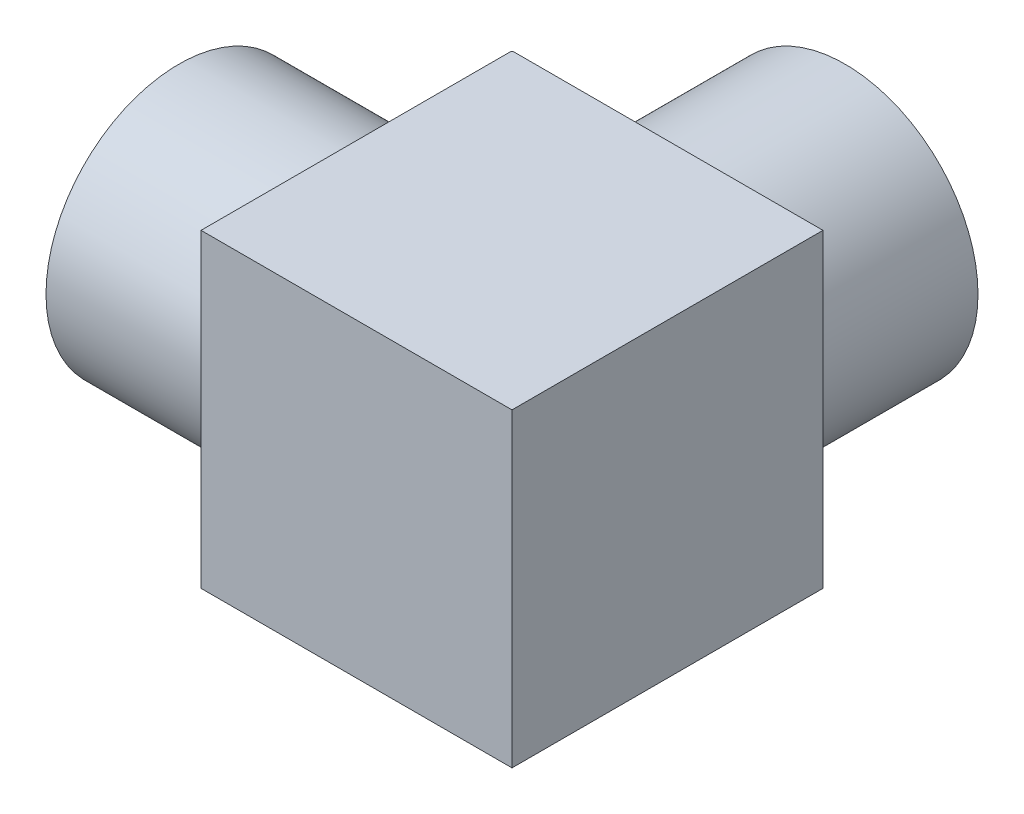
ISO-10303-21;
HEADER;
FILE_DESCRIPTION(('STEP AP214'),'2;1');
FILE_NAME('part.step','',(''),(''),'','','');
FILE_SCHEMA(('AUTOMOTIVE_DESIGN { 1 0 10303 214 1 1 1 1 }'));
ENDSEC;
DATA;
#1=APPLICATION_CONTEXT('core data for automotive mechanical design processes');
#2=APPLICATION_PROTOCOL_DEFINITION('international standard','automotive_design',2000,#1);
#3=PRODUCT_CONTEXT('',#1,'mechanical');
#4=PRODUCT('Part','Part','',(#3));
#5=PRODUCT_RELATED_PRODUCT_CATEGORY('part','',(#4));
#6=PRODUCT_DEFINITION_FORMATION('','',#4);
#7=PRODUCT_DEFINITION_CONTEXT('part definition',#1,'design');
#8=PRODUCT_DEFINITION('design','',#6,#7);
#9=PRODUCT_DEFINITION_SHAPE('','',#8);
#10=(LENGTH_UNIT() NAMED_UNIT(*) SI_UNIT(.MILLI.,.METRE.));
#11=(NAMED_UNIT(*) PLANE_ANGLE_UNIT() SI_UNIT($,.RADIAN.));
#12=(NAMED_UNIT(*) SI_UNIT($,.STERADIAN.) SOLID_ANGLE_UNIT());
#13=UNCERTAINTY_MEASURE_WITH_UNIT(LENGTH_MEASURE(1.E-05),#10,'distance_accuracy_value','');
#14=(GEOMETRIC_REPRESENTATION_CONTEXT(3) GLOBAL_UNCERTAINTY_ASSIGNED_CONTEXT((#13)) GLOBAL_UNIT_ASSIGNED_CONTEXT((#10,
#11,#12)) REPRESENTATION_CONTEXT('',''));
#15=CARTESIAN_POINT('',(0.,0.,0.));
#16=DIRECTION('',(0.,0.,1.));
#17=DIRECTION('',(1.,0.,0.));
#18=AXIS2_PLACEMENT_3D('',#15,#16,#17);
#19=CARTESIAN_POINT('',(6.34999999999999,5.55625000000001,-5.55625));
#20=DIRECTION('',(0.,0.,-1.));
#21=DIRECTION('',(-1.,0.,0.));
#22=AXIS2_PLACEMENT_3D('',#19,#20,#21);
#23=PLANE('',#22);
#24=DIRECTION('',(0.,1.,0.));
#25=VECTOR('',#24,1.);
#26=CARTESIAN_POINT('',(6.34999999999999,0.,-5.55625));
#27=LINE('',#26,#25);
#28=CARTESIAN_POINT('',(6.34999999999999,5.55625000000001,-5.55625));
#29=VERTEX_POINT('',#28);
#30=CARTESIAN_POINT('',(6.34999999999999,-5.55625,-5.55625));
#31=VERTEX_POINT('',#30);
#32=EDGE_CURVE('E166',#29,#31,#27,.F.);
#33=ORIENTED_EDGE('',*,*,#32,.F.);
#34=DIRECTION('',(-1.,0.,0.));
#35=VECTOR('',#34,1.);
#36=CARTESIAN_POINT('',(6.34999999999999,5.55625000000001,-5.55625));
#37=LINE('',#36,#35);
#38=CARTESIAN_POINT('',(6.38175000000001,5.55625000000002,-5.55625));
#39=VERTEX_POINT('',#38);
#40=EDGE_CURVE('E171',#29,#39,#37,.F.);
#41=ORIENTED_EDGE('',*,*,#40,.T.);
#42=DIRECTION('',(0.,-1.,0.));
#43=VECTOR('',#42,1.);
#44=CARTESIAN_POINT('',(6.38175000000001,5.55625000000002,-5.55625));
#45=LINE('',#44,#43);
#46=CARTESIAN_POINT('',(6.38174999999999,-5.55625,-5.55625));
#47=VERTEX_POINT('',#46);
#48=EDGE_CURVE('E163',#47,#39,#45,.F.);
#49=ORIENTED_EDGE('',*,*,#48,.F.);
#50=DIRECTION('',(-1.,0.,0.));
#51=VECTOR('',#50,1.);
#52=CARTESIAN_POINT('',(6.34999999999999,-5.55625,-5.55625));
#53=LINE('',#52,#51);
#54=EDGE_CURVE('E172',#47,#31,#53,.T.);
#55=ORIENTED_EDGE('',*,*,#54,.T.);
#56=EDGE_LOOP('',(#33,#41,#49,#55));
#57=FACE_BOUND('',#56,.T.);
#58=ADVANCED_FACE('F16',(#57),#23,.T.);
#59=CARTESIAN_POINT('',(6.34999999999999,-5.55624999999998,5.55625));
#60=DIRECTION('',(0.,0.,1.));
#61=DIRECTION('',(0.,-1.,0.));
#62=AXIS2_PLACEMENT_3D('',#59,#60,#61);
#63=PLANE('',#62);
#64=DIRECTION('',(0.,1.,0.));
#65=VECTOR('',#64,1.);
#66=CARTESIAN_POINT('',(6.34999999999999,0.,5.55625));
#67=LINE('',#66,#65);
#68=CARTESIAN_POINT('',(6.34999999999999,-5.55624999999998,5.55625));
#69=VERTEX_POINT('',#68);
#70=CARTESIAN_POINT('',(6.34999999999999,5.55625000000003,5.55625));
#71=VERTEX_POINT('',#70);
#72=EDGE_CURVE('E169',#69,#71,#67,.T.);
#73=ORIENTED_EDGE('',*,*,#72,.F.);
#74=DIRECTION('',(1.,0.,0.));
#75=VECTOR('',#74,1.);
#76=CARTESIAN_POINT('',(6.34999999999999,-5.55624999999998,5.55625));
#77=LINE('',#76,#75);
#78=CARTESIAN_POINT('',(17.49425,-5.55624999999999,5.55625));
#79=VERTEX_POINT('',#78);
#80=EDGE_CURVE('E143',#79,#69,#77,.F.);
#81=ORIENTED_EDGE('',*,*,#80,.F.);
#82=DIRECTION('',(0.,1.,0.));
#83=VECTOR('',#82,1.);
#84=CARTESIAN_POINT('',(17.49425,0.,5.55625000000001));
#85=LINE('',#84,#83);
#86=CARTESIAN_POINT('',(17.49425,5.55625000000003,5.55625));
#87=VERTEX_POINT('',#86);
#88=EDGE_CURVE('E150',#87,#79,#85,.F.);
#89=ORIENTED_EDGE('',*,*,#88,.F.);
#90=DIRECTION('',(1.,0.,0.));
#91=VECTOR('',#90,1.);
#92=CARTESIAN_POINT('',(6.34999999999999,5.55625000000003,5.55625));
#93=LINE('',#92,#91);
#94=EDGE_CURVE('E158',#71,#87,#93,.T.);
#95=ORIENTED_EDGE('',*,*,#94,.F.);
#96=EDGE_LOOP('',(#73,#81,#89,#95));
#97=FACE_BOUND('',#96,.T.);
#98=ADVANCED_FACE('F190',(#97),#63,.T.);
#99=CARTESIAN_POINT('',(6.34999999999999,0.,-2.778125));
#100=DIRECTION('',(-1.,0.,0.));
#101=DIRECTION('',(0.,0.,1.));
#102=AXIS2_PLACEMENT_3D('',#99,#100,#101);
#103=PLANE('',#102);
#104=DIRECTION('',(0.,0.,1.));
#105=VECTOR('',#104,1.);
#106=CARTESIAN_POINT('',(6.34999999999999,5.55625000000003,5.55625));
#107=LINE('',#106,#105);
#108=EDGE_CURVE('E160',#29,#71,#107,.T.);
#109=ORIENTED_EDGE('',*,*,#108,.F.);
#110=ORIENTED_EDGE('',*,*,#32,.T.);
#111=DIRECTION('',(0.,0.,1.));
#112=VECTOR('',#111,1.);
#113=CARTESIAN_POINT('',(6.34999999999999,-5.55625,-5.55625));
#114=LINE('',#113,#112);
#115=EDGE_CURVE('E140',#69,#31,#114,.F.);
#116=ORIENTED_EDGE('',*,*,#115,.F.);
#117=ORIENTED_EDGE('',*,*,#72,.T.);
#118=EDGE_LOOP('',(#109,#110,#116,#117));
#119=FACE_BOUND('',#118,.T.);
#120=CARTESIAN_POINT('',(6.34999999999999,0.,0.));
#121=DIRECTION('',(-1.,0.,0.));
#122=DIRECTION('',(0.,0.,1.));
#123=AXIS2_PLACEMENT_3D('',#120,#121,#122);
#124=CIRCLE('',#123,4.7625);
#125=CARTESIAN_POINT('',(6.34999999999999,0.,4.7625));
#126=VERTEX_POINT('',#125);
#127=EDGE_CURVE('E19',#126,#126,#124,.T.);
#128=ORIENTED_EDGE('',*,*,#127,.F.);
#129=EDGE_LOOP('',(#128));
#130=FACE_BOUND('',#129,.T.);
#131=ADVANCED_FACE('F181',(#119,#130),#103,.T.);
#132=CARTESIAN_POINT('',(6.38175000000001,5.55625000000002,0.));
#133=DIRECTION('',(-1.,0.,0.));
#134=DIRECTION('',(0.,-1.,0.));
#135=AXIS2_PLACEMENT_3D('',#132,#133,#134);
#136=PLANE('',#135);
#137=DIRECTION('',(0.,1.,0.));
#138=VECTOR('',#137,1.);
#139=CARTESIAN_POINT('',(6.38175000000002,0.,-5.588));
#140=LINE('',#139,#138);
#141=CARTESIAN_POINT('',(6.38174999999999,-5.55625,-5.588));
#142=VERTEX_POINT('',#141);
#143=CARTESIAN_POINT('',(6.38175000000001,5.55625000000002,-5.588));
#144=VERTEX_POINT('',#143);
#145=EDGE_CURVE('E138',#142,#144,#140,.T.);
#146=ORIENTED_EDGE('',*,*,#145,.F.);
#147=DIRECTION('',(0.,0.,1.));
#148=VECTOR('',#147,1.);
#149=CARTESIAN_POINT('',(6.38174999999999,-5.55625,-5.55625));
#150=LINE('',#149,#148);
#151=EDGE_CURVE('E148',#47,#142,#150,.F.);
#152=ORIENTED_EDGE('',*,*,#151,.F.);
#153=ORIENTED_EDGE('',*,*,#48,.T.);
#154=DIRECTION('',(0.,0.,1.));
#155=VECTOR('',#154,1.);
#156=CARTESIAN_POINT('',(6.38175000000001,5.55625000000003,5.55625));
#157=LINE('',#156,#155);
#158=EDGE_CURVE('E155',#144,#39,#157,.T.);
#159=ORIENTED_EDGE('',*,*,#158,.F.);
#160=EDGE_LOOP('',(#146,#152,#153,#159));
#161=FACE_BOUND('',#160,.T.);
#162=ADVANCED_FACE('F197',(#161),#136,.T.);
#163=CARTESIAN_POINT('',(6.34999999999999,5.55625000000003,5.55625));
#164=DIRECTION('',(0.,1.,0.));
#165=DIRECTION('',(0.,0.,1.));
#166=AXIS2_PLACEMENT_3D('',#163,#164,#165);
#167=PLANE('',#166);
#168=DIRECTION('',(-1.,0.,0.));
#169=VECTOR('',#168,1.);
#170=CARTESIAN_POINT('',(14.716125,5.55625000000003,-5.58799999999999));
#171=LINE('',#170,#169);
#172=CARTESIAN_POINT('',(17.49425,5.55625000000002,-5.58799999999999));
#173=VERTEX_POINT('',#172);
#174=EDGE_CURVE('E133',#144,#173,#171,.F.);
#175=ORIENTED_EDGE('',*,*,#174,.F.);
#176=ORIENTED_EDGE('',*,*,#158,.T.);
#177=ORIENTED_EDGE('',*,*,#40,.F.);
#178=ORIENTED_EDGE('',*,*,#108,.T.);
#179=ORIENTED_EDGE('',*,*,#94,.T.);
#180=DIRECTION('',(0.,0.,1.));
#181=VECTOR('',#180,1.);
#182=CARTESIAN_POINT('',(17.49425,5.55625000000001,0.));
#183=LINE('',#182,#181);
#184=EDGE_CURVE('E152',#173,#87,#183,.T.);
#185=ORIENTED_EDGE('',*,*,#184,.F.);
#186=EDGE_LOOP('',(#175,#176,#177,#178,#179,#185));
#187=FACE_BOUND('',#186,.T.);
#188=ADVANCED_FACE('F193',(#187),#167,.T.);
#189=CARTESIAN_POINT('',(17.49425,0.,0.));
#190=DIRECTION('',(1.,0.,0.));
#191=DIRECTION('',(0.,1.,0.));
#192=AXIS2_PLACEMENT_3D('',#189,#190,#191);
#193=PLANE('',#192);
#194=DIRECTION('',(0.,0.,1.));
#195=VECTOR('',#194,1.);
#196=CARTESIAN_POINT('',(17.49425,-5.55624999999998,-5.55625));
#197=LINE('',#196,#195);
#198=CARTESIAN_POINT('',(17.49425,-5.55624999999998,-5.588));
#199=VERTEX_POINT('',#198);
#200=EDGE_CURVE('E145',#199,#79,#197,.T.);
#201=ORIENTED_EDGE('',*,*,#200,.F.);
#202=DIRECTION('',(0.,1.,0.));
#203=VECTOR('',#202,1.);
#204=CARTESIAN_POINT('',(17.49425,0.,-5.588));
#205=LINE('',#204,#203);
#206=EDGE_CURVE('E128',#173,#199,#205,.F.);
#207=ORIENTED_EDGE('',*,*,#206,.F.);
#208=ORIENTED_EDGE('',*,*,#184,.T.);
#209=ORIENTED_EDGE('',*,*,#88,.T.);
#210=EDGE_LOOP('',(#201,#207,#208,#209));
#211=FACE_BOUND('',#210,.T.);
#212=ADVANCED_FACE('F202',(#211),#193,.T.);
#213=CARTESIAN_POINT('',(6.34999999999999,-5.55625,-5.55625));
#214=DIRECTION('',(0.,-1.,0.));
#215=DIRECTION('',(1.,0.,0.));
#216=AXIS2_PLACEMENT_3D('',#213,#214,#215);
#217=PLANE('',#216);
#218=ORIENTED_EDGE('',*,*,#115,.T.);
#219=ORIENTED_EDGE('',*,*,#54,.F.);
#220=ORIENTED_EDGE('',*,*,#151,.T.);
#221=DIRECTION('',(-1.,0.,0.));
#222=VECTOR('',#221,1.);
#223=CARTESIAN_POINT('',(14.716125,-5.55624999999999,-5.588));
#224=LINE('',#223,#222);
#225=EDGE_CURVE('E124',#199,#142,#224,.T.);
#226=ORIENTED_EDGE('',*,*,#225,.F.);
#227=ORIENTED_EDGE('',*,*,#200,.T.);
#228=ORIENTED_EDGE('',*,*,#80,.T.);
#229=EDGE_LOOP('',(#218,#219,#220,#226,#227,#228));
#230=FACE_BOUND('',#229,.T.);
#231=ADVANCED_FACE('F183',(#230),#217,.T.);
#232=CARTESIAN_POINT('',(3.17500000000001,0.,0.));
#233=DIRECTION('',(-1.,0.,0.));
#234=DIRECTION('',(0.,0.,1.));
#235=AXIS2_PLACEMENT_3D('',#232,#233,#234);
#236=CYLINDRICAL_SURFACE('',#235,4.7625);
#237=CARTESIAN_POINT('',(0.,0.,0.));
#238=DIRECTION('',(-1.,0.,0.));
#239=DIRECTION('',(0.,0.,1.));
#240=AXIS2_PLACEMENT_3D('',#237,#238,#239);
#241=CIRCLE('',#240,4.7625);
#242=CARTESIAN_POINT('',(0.,0.,4.7625));
#243=VERTEX_POINT('',#242);
#244=EDGE_CURVE('E122',#243,#243,#241,.T.);
#245=ORIENTED_EDGE('',*,*,#244,.F.);
#246=EDGE_LOOP('',(#245));
#247=FACE_BOUND('',#246,.T.);
#248=ORIENTED_EDGE('',*,*,#127,.T.);
#249=EDGE_LOOP('',(#248));
#250=FACE_BOUND('',#249,.T.);
#251=ADVANCED_FACE('F209',(#247,#250),#236,.T.);
#252=CARTESIAN_POINT('',(14.716125,0.,-5.588));
#253=DIRECTION('',(0.,0.,-1.));
#254=DIRECTION('',(-1.,0.,0.));
#255=AXIS2_PLACEMENT_3D('',#252,#253,#254);
#256=PLANE('',#255);
#257=ORIENTED_EDGE('',*,*,#206,.T.);
#258=ORIENTED_EDGE('',*,*,#225,.T.);
#259=ORIENTED_EDGE('',*,*,#145,.T.);
#260=ORIENTED_EDGE('',*,*,#174,.T.);
#261=EDGE_LOOP('',(#257,#258,#259,#260));
#262=FACE_BOUND('',#261,.T.);
#263=CARTESIAN_POINT('',(11.938,0.,-5.588));
#264=DIRECTION('',(0.,0.,-1.));
#265=DIRECTION('',(-1.,0.,0.));
#266=AXIS2_PLACEMENT_3D('',#263,#264,#265);
#267=CIRCLE('',#266,4.7625);
#268=CARTESIAN_POINT('',(7.1755,0.,-5.588));
#269=VERTEX_POINT('',#268);
#270=EDGE_CURVE('E118',#269,#269,#267,.T.);
#271=ORIENTED_EDGE('',*,*,#270,.F.);
#272=EDGE_LOOP('',(#271));
#273=FACE_BOUND('',#272,.T.);
#274=ADVANCED_FACE('F198',(#262,#273),#256,.T.);
#275=CARTESIAN_POINT('',(0.,0.,-2.38125));
#276=DIRECTION('',(-1.,0.,0.));
#277=DIRECTION('',(0.,0.,1.));
#278=AXIS2_PLACEMENT_3D('',#275,#276,#277);
#279=PLANE('',#278);
#280=ORIENTED_EDGE('',*,*,#244,.T.);
#281=EDGE_LOOP('',(#280));
#282=FACE_BOUND('',#281,.T.);
#283=CARTESIAN_POINT('',(0.,0.,0.));
#284=DIRECTION('',(1.,0.,0.));
#285=DIRECTION('',(0.,0.,-1.));
#286=AXIS2_PLACEMENT_3D('',#283,#284,#285);
#287=CIRCLE('',#286,3.8735);
#288=CARTESIAN_POINT('',(0.,0.,-3.8735));
#289=VERTEX_POINT('',#288);
#290=EDGE_CURVE('E114',#289,#289,#287,.T.);
#291=ORIENTED_EDGE('',*,*,#290,.T.);
#292=EDGE_LOOP('',(#291));
#293=FACE_BOUND('',#292,.T.);
#294=ADVANCED_FACE('F87',(#282,#293),#279,.T.);
#295=CARTESIAN_POINT('',(11.938,0.,-8.763));
#296=DIRECTION('',(0.,0.,-1.));
#297=DIRECTION('',(-1.,0.,0.));
#298=AXIS2_PLACEMENT_3D('',#295,#296,#297);
#299=CYLINDRICAL_SURFACE('',#298,4.7625);
#300=CARTESIAN_POINT('',(11.938,0.,-11.938));
#301=DIRECTION('',(0.,0.,-1.));
#302=DIRECTION('',(-1.,0.,0.));
#303=AXIS2_PLACEMENT_3D('',#300,#301,#302);
#304=CIRCLE('',#303,4.7625);
#305=CARTESIAN_POINT('',(7.1755,0.,-11.938));
#306=VERTEX_POINT('',#305);
#307=EDGE_CURVE('E105',#306,#306,#304,.T.);
#308=ORIENTED_EDGE('',*,*,#307,.F.);
#309=EDGE_LOOP('',(#308));
#310=FACE_BOUND('',#309,.T.);
#311=ORIENTED_EDGE('',*,*,#270,.T.);
#312=EDGE_LOOP('',(#311));
#313=FACE_BOUND('',#312,.T.);
#314=ADVANCED_FACE('F76',(#310,#313),#299,.T.);
#315=CARTESIAN_POINT('',(11.938,0.,0.));
#316=DIRECTION('',(0.86411097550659,0.4351361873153,0.252920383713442));
#317=DIRECTION('',(-0.477419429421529,0.867734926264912,0.138227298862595));
#318=AXIS2_PLACEMENT_3D('',#315,#316,#317);
#319=SPHERICAL_SURFACE('',#318,3.8735);
#320=CARTESIAN_POINT('',(11.938,0.,0.));
#321=DIRECTION('',(0.,0.,1.));
#322=DIRECTION('',(1.,0.,0.));
#323=AXIS2_PLACEMENT_3D('',#320,#321,#322);
#324=CIRCLE('',#323,3.8735);
#325=CARTESIAN_POINT('',(11.938,3.87350000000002,0.));
#326=VERTEX_POINT('',#325);
#327=CARTESIAN_POINT('',(11.938,-3.8735,0.));
#328=VERTEX_POINT('',#327);
#329=EDGE_CURVE('E104',#326,#328,#324,.F.);
#330=ORIENTED_EDGE('',*,*,#329,.T.);
#331=CARTESIAN_POINT('',(11.938,0.,0.));
#332=DIRECTION('',(1.,0.,0.));
#333=DIRECTION('',(0.,0.,-1.));
#334=AXIS2_PLACEMENT_3D('',#331,#332,#333);
#335=CIRCLE('',#334,3.8735);
#336=EDGE_CURVE('E31',#328,#326,#335,.F.);
#337=ORIENTED_EDGE('',*,*,#336,.T.);
#338=EDGE_LOOP('',(#330,#337));
#339=FACE_BOUND('',#338,.T.);
#340=CARTESIAN_POINT('',(15.2851338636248,1.68550002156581,0.979687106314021));
#341=VERTEX_POINT('',#340);
#342=VERTEX_LOOP('',#341);
#343=FACE_BOUND('',#342,.T.);
#344=ADVANCED_FACE('F73',(#339,#343),#319,.F.);
#345=CARTESIAN_POINT('',(5.969,0.,0.));
#346=DIRECTION('',(1.,0.,0.));
#347=DIRECTION('',(0.,0.,-1.));
#348=AXIS2_PLACEMENT_3D('',#345,#346,#347);
#349=CYLINDRICAL_SURFACE('',#348,3.8735);
#350=ORIENTED_EDGE('',*,*,#290,.F.);
#351=EDGE_LOOP('',(#350));
#352=FACE_BOUND('',#351,.T.);
#353=CARTESIAN_POINT('',(11.938,0.,0.));
#354=DIRECTION('',(0.707106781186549,0.,-0.707106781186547));
#355=DIRECTION('',(0.707106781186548,0.,0.707106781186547));
#356=AXIS2_PLACEMENT_3D('',#353,#354,#355);
#357=ELLIPSE('',#356,5.47795623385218,3.8735);
#358=EDGE_CURVE('E25',#328,#326,#357,.T.);
#359=ORIENTED_EDGE('',*,*,#358,.T.);
#360=ORIENTED_EDGE('',*,*,#336,.F.);
#361=EDGE_LOOP('',(#359,#360));
#362=FACE_BOUND('',#361,.T.);
#363=ADVANCED_FACE('F75',(#352,#362),#349,.F.);
#364=CARTESIAN_POINT('',(14.31925,0.,-11.938));
#365=DIRECTION('',(0.,0.,-1.));
#366=DIRECTION('',(-1.,0.,0.));
#367=AXIS2_PLACEMENT_3D('',#364,#365,#366);
#368=PLANE('',#367);
#369=ORIENTED_EDGE('',*,*,#307,.T.);
#370=EDGE_LOOP('',(#369));
#371=FACE_BOUND('',#370,.T.);
#372=CARTESIAN_POINT('',(11.938,0.,-11.938));
#373=DIRECTION('',(0.,0.,1.));
#374=DIRECTION('',(1.,0.,0.));
#375=AXIS2_PLACEMENT_3D('',#372,#373,#374);
#376=CIRCLE('',#375,3.8735);
#377=CARTESIAN_POINT('',(15.8115,0.,-11.938));
#378=VERTEX_POINT('',#377);
#379=EDGE_CURVE('E11',#378,#378,#376,.T.);
#380=ORIENTED_EDGE('',*,*,#379,.T.);
#381=EDGE_LOOP('',(#380));
#382=FACE_BOUND('',#381,.T.);
#383=ADVANCED_FACE('F84',(#371,#382),#368,.T.);
#384=CARTESIAN_POINT('',(11.938,0.,-5.969));
#385=DIRECTION('',(0.,0.,1.));
#386=DIRECTION('',(1.,0.,0.));
#387=AXIS2_PLACEMENT_3D('',#384,#385,#386);
#388=CYLINDRICAL_SURFACE('',#387,3.8735);
#389=ORIENTED_EDGE('',*,*,#379,.F.);
#390=EDGE_LOOP('',(#389));
#391=FACE_BOUND('',#390,.T.);
#392=ORIENTED_EDGE('',*,*,#329,.F.);
#393=ORIENTED_EDGE('',*,*,#358,.F.);
#394=EDGE_LOOP('',(#392,#393));
#395=FACE_BOUND('',#394,.T.);
#396=ADVANCED_FACE('F92',(#391,#395),#388,.F.);
#397=CLOSED_SHELL('',(#58,#98,#131,#162,#188,#212,#231,#251,#274,#294,#314,#344,#363,#383,#396));
#398=MANIFOLD_SOLID_BREP('B1',#397);
#399=ADVANCED_BREP_SHAPE_REPRESENTATION('',(#18,#398),#14);
#400=SHAPE_DEFINITION_REPRESENTATION(#9,#399);
ENDSEC;
END-ISO-10303-21;
